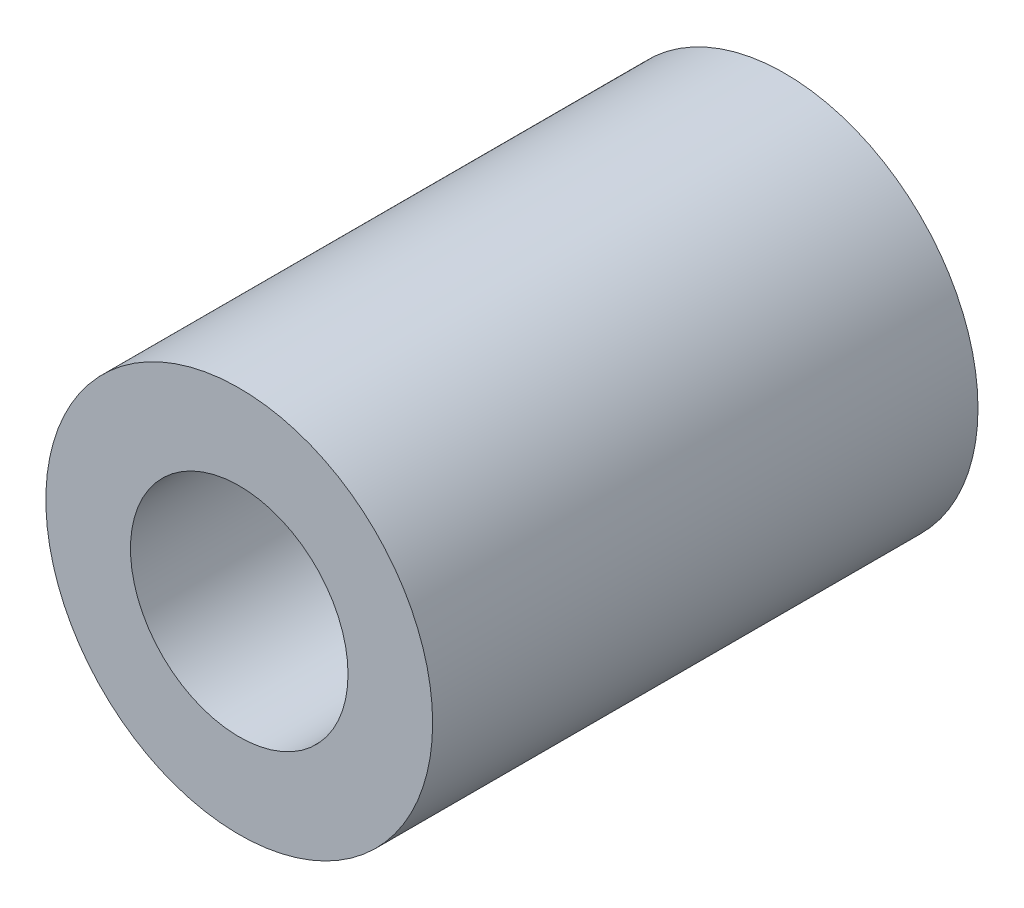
ISO-10303-21;
HEADER;
FILE_DESCRIPTION(('STEP AP214'),'2;1');
FILE_NAME('part.step','',(''),(''),'','','');
FILE_SCHEMA(('AUTOMOTIVE_DESIGN { 1 0 10303 214 1 1 1 1 }'));
ENDSEC;
DATA;
#1=APPLICATION_CONTEXT('core data for automotive mechanical design processes');
#2=APPLICATION_PROTOCOL_DEFINITION('international standard','automotive_design',2000,#1);
#3=PRODUCT_CONTEXT('',#1,'mechanical');
#4=PRODUCT('Part','Part','',(#3));
#5=PRODUCT_RELATED_PRODUCT_CATEGORY('part','',(#4));
#6=PRODUCT_DEFINITION_FORMATION('','',#4);
#7=PRODUCT_DEFINITION_CONTEXT('part definition',#1,'design');
#8=PRODUCT_DEFINITION('design','',#6,#7);
#9=PRODUCT_DEFINITION_SHAPE('','',#8);
#10=(LENGTH_UNIT() NAMED_UNIT(*) SI_UNIT(.MILLI.,.METRE.));
#11=(NAMED_UNIT(*) PLANE_ANGLE_UNIT() SI_UNIT($,.RADIAN.));
#12=(NAMED_UNIT(*) SI_UNIT($,.STERADIAN.) SOLID_ANGLE_UNIT());
#13=UNCERTAINTY_MEASURE_WITH_UNIT(LENGTH_MEASURE(1.E-05),#10,'distance_accuracy_value','');
#14=(GEOMETRIC_REPRESENTATION_CONTEXT(3) GLOBAL_UNCERTAINTY_ASSIGNED_CONTEXT((#13)) GLOBAL_UNIT_ASSIGNED_CONTEXT((#10,
#11,#12)) REPRESENTATION_CONTEXT('',''));
#15=CARTESIAN_POINT('',(0.,0.,0.));
#16=DIRECTION('',(0.,0.,1.));
#17=DIRECTION('',(1.,0.,0.));
#18=AXIS2_PLACEMENT_3D('',#15,#16,#17);
#19=CARTESIAN_POINT('',(0.,0.,4.47675));
#20=DIRECTION('',(0.,0.,1.));
#21=DIRECTION('',(1.,0.,0.));
#22=AXIS2_PLACEMENT_3D('',#19,#20,#21);
#23=PLANE('',#22);
#24=CARTESIAN_POINT('',(0.,0.,4.47675));
#25=DIRECTION('',(0.,0.,1.));
#26=DIRECTION('',(1.,0.,0.));
#27=AXIS2_PLACEMENT_3D('',#24,#25,#26);
#28=CIRCLE('',#27,3.175);
#29=CARTESIAN_POINT('',(3.175,0.,4.47675));
#30=VERTEX_POINT('',#29);
#31=EDGE_CURVE('E10',#30,#30,#28,.T.);
#32=ORIENTED_EDGE('',*,*,#31,.T.);
#33=EDGE_LOOP('',(#32));
#34=FACE_BOUND('',#33,.T.);
#35=CARTESIAN_POINT('',(0.,0.,4.47675));
#36=DIRECTION('',(0.,0.,1.));
#37=DIRECTION('',(1.,0.,0.));
#38=AXIS2_PLACEMENT_3D('',#35,#36,#37);
#39=CIRCLE('',#38,1.7859375);
#40=CARTESIAN_POINT('',(1.7859375,0.,4.47675));
#41=VERTEX_POINT('',#40);
#42=EDGE_CURVE('E46',#41,#41,#39,.T.);
#43=ORIENTED_EDGE('',*,*,#42,.F.);
#44=EDGE_LOOP('',(#43));
#45=FACE_BOUND('',#44,.T.);
#46=ADVANCED_FACE('F35',(#34,#45),#23,.T.);
#47=CARTESIAN_POINT('',(0.,0.,-4.47675));
#48=DIRECTION('',(0.,0.,1.));
#49=DIRECTION('',(1.,0.,0.));
#50=AXIS2_PLACEMENT_3D('',#47,#48,#49);
#51=PLANE('',#50);
#52=CARTESIAN_POINT('',(0.,0.,-4.47675));
#53=DIRECTION('',(0.,0.,1.));
#54=DIRECTION('',(1.,0.,0.));
#55=AXIS2_PLACEMENT_3D('',#52,#53,#54);
#56=CIRCLE('',#55,3.175);
#57=CARTESIAN_POINT('',(3.175,0.,-4.47675));
#58=VERTEX_POINT('',#57);
#59=EDGE_CURVE('E39',#58,#58,#56,.T.);
#60=ORIENTED_EDGE('',*,*,#59,.F.);
#61=EDGE_LOOP('',(#60));
#62=FACE_BOUND('',#61,.T.);
#63=CARTESIAN_POINT('',(0.,0.,-4.47675));
#64=DIRECTION('',(0.,0.,1.));
#65=DIRECTION('',(1.,0.,0.));
#66=AXIS2_PLACEMENT_3D('',#63,#64,#65);
#67=CIRCLE('',#66,1.7859375);
#68=CARTESIAN_POINT('',(1.7859375,0.,-4.47675));
#69=VERTEX_POINT('',#68);
#70=EDGE_CURVE('E48',#69,#69,#67,.T.);
#71=ORIENTED_EDGE('',*,*,#70,.T.);
#72=EDGE_LOOP('',(#71));
#73=FACE_BOUND('',#72,.T.);
#74=ADVANCED_FACE('F58',(#62,#73),#51,.F.);
#75=CARTESIAN_POINT('',(0.,0.,4.47675));
#76=DIRECTION('',(0.,0.,-1.));
#77=DIRECTION('',(-1.,0.,0.));
#78=AXIS2_PLACEMENT_3D('',#75,#76,#77);
#79=CYLINDRICAL_SURFACE('',#78,3.175);
#80=ORIENTED_EDGE('',*,*,#31,.F.);
#81=EDGE_LOOP('',(#80));
#82=FACE_BOUND('',#81,.T.);
#83=ORIENTED_EDGE('',*,*,#59,.T.);
#84=EDGE_LOOP('',(#83));
#85=FACE_BOUND('',#84,.T.);
#86=ADVANCED_FACE('F37',(#82,#85),#79,.T.);
#87=CARTESIAN_POINT('',(0.,0.,4.47675));
#88=DIRECTION('',(0.,0.,-1.));
#89=DIRECTION('',(-1.,0.,0.));
#90=AXIS2_PLACEMENT_3D('',#87,#88,#89);
#91=CYLINDRICAL_SURFACE('',#90,1.7859375);
#92=ORIENTED_EDGE('',*,*,#42,.T.);
#93=EDGE_LOOP('',(#92));
#94=FACE_BOUND('',#93,.T.);
#95=ORIENTED_EDGE('',*,*,#70,.F.);
#96=EDGE_LOOP('',(#95));
#97=FACE_BOUND('',#96,.T.);
#98=ADVANCED_FACE('F54',(#94,#97),#91,.F.);
#99=CLOSED_SHELL('',(#46,#74,#86,#98));
#100=MANIFOLD_SOLID_BREP('B2',#99);
#101=ADVANCED_BREP_SHAPE_REPRESENTATION('',(#18,#100),#14);
#102=SHAPE_DEFINITION_REPRESENTATION(#9,#101);
ENDSEC;
END-ISO-10303-21;
